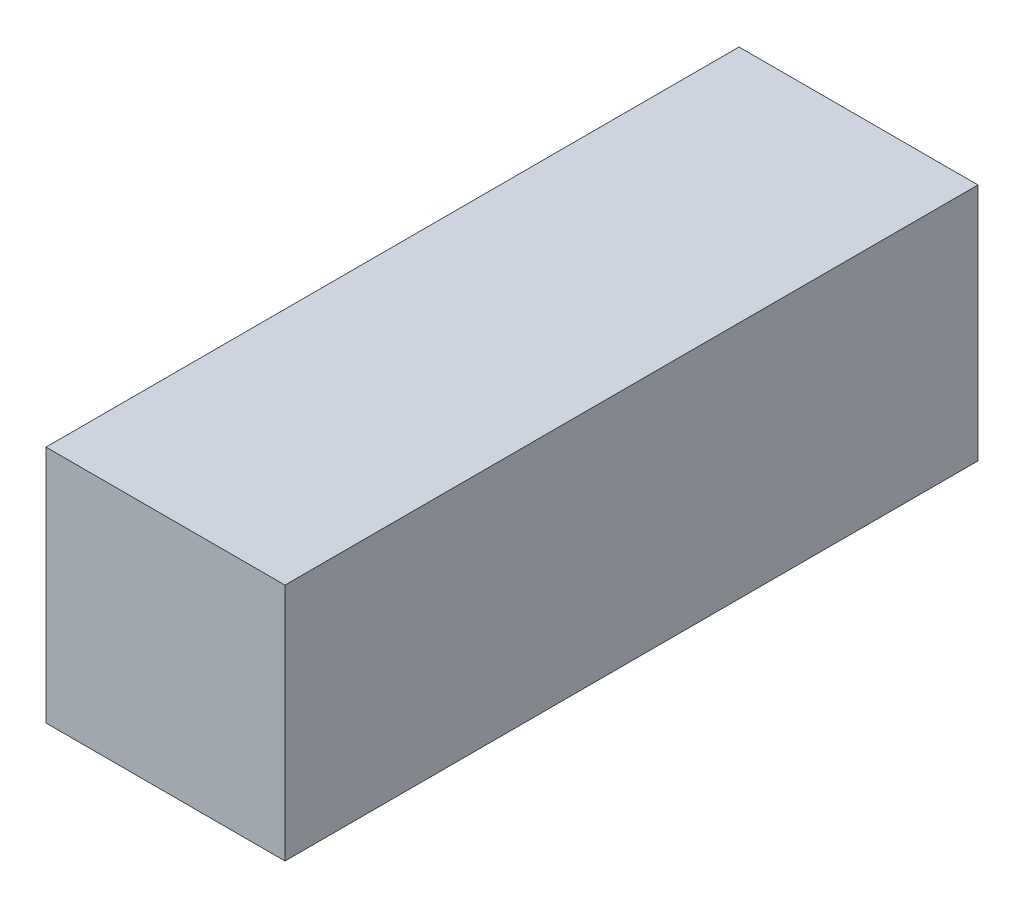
from build123d import *

# Parameters (mm, degrees)
SKETCH_1_W                = 20
SKETCH_1_H                = 20
V2_REF_GRIPPER_BODY_DEPTH = 58


with BuildPart() as part:
    # Sketch 1 → V2_REF_gripper_body (new body)
    with BuildSketch(Plane.XY):
        with Locations((10, 10)):
            Rectangle(SKETCH_1_W, SKETCH_1_H)
    extrude(amount=V2_REF_GRIPPER_BODY_DEPTH)


solid = part.part
